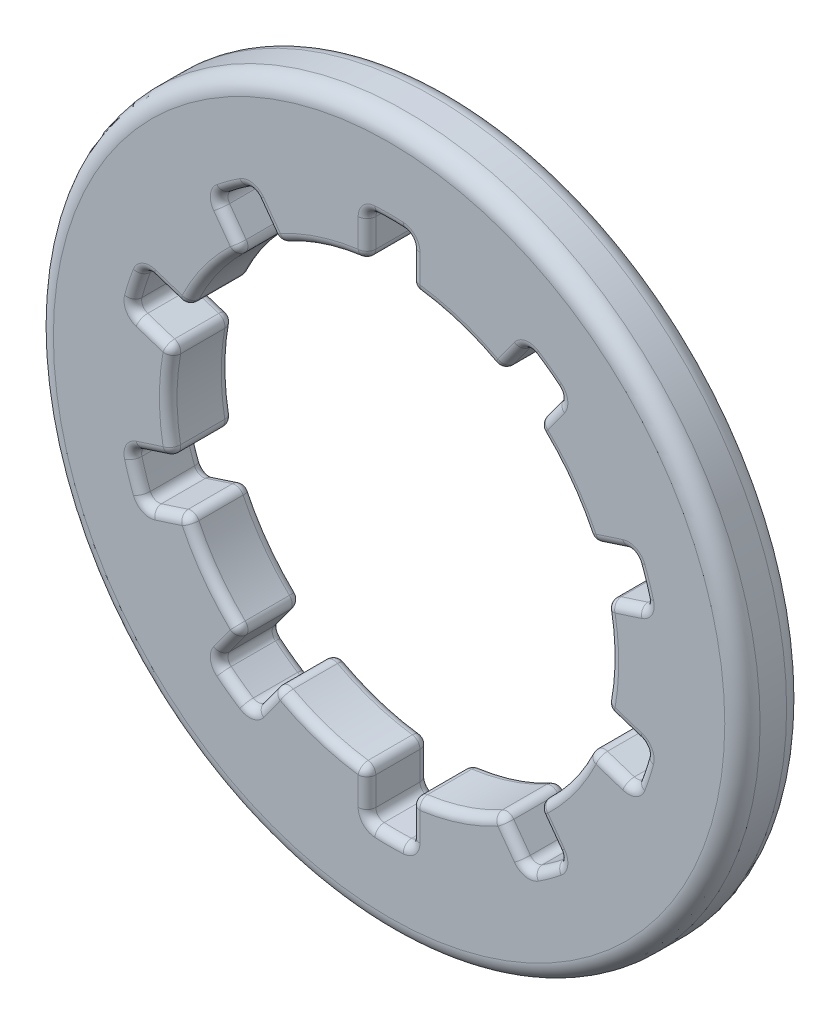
from build123d import *

# Parameters (mm, degrees)
ESQUISSE1_R                  = 4
BASE_EXTRUSION_DEPTH         = 0.7
CONG_1_R                     = 0.2
ENL_V_MAT_EXTRU_1_DEPTH      = 6.70000014
R_P_TITION_CIRCULAIRE1_COUNT = 5
R_P_TITION_CIRCULAIRE1_ANGLE = 144
CONG_2_R                     = 0.1


with BuildPart() as part:
    # Esquisse1 → Base-Extrusion (new body)
    with BuildSketch(Plane.XY):
        Circle(ESQUISSE1_R)
    extrude(amount=BASE_EXTRUSION_DEPTH)

    # Cong_1
    cong_1_edges = [part.edges().sort_by_distance(p)[0] for p in [
        (-4, 0, 0),
        (-4, 0, 0.7),
    ]]
    fillet(cong_1_edges, radius=CONG_1_R)

    # Esquisse2 → Enl_v. mat.-Extru.1 (cut, through all)
    with BuildSketch(Plane.XY.offset(0.7)):
        with BuildLine():
            Line((-0.25, 2.896118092), (-0.25, 2.487468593))
            ThreePointArc((-0.25, 2.487468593), (-2.5, 0), (-0.25, -2.487468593))
            Line((-0.25, -2.487468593), (-0.25, -2.896118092))
            ThreePointArc((-0.25, -2.896118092), (-0.222516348, -2.964975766), (-0.155172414, -2.995984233))
            ThreePointArc((-0.155172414, -2.995984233), (0, -3), (0.155172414, -2.995984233))
            ThreePointArc((0.155172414, -2.995984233), (0.222516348, -2.964975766), (0.25, -2.896118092))
            Line((0.25, -2.896118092), (0.25, -2.487468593))
            ThreePointArc((0.25, -2.487468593), (2.5, 0), (0.25, 2.487468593))
            Line((0.25, 2.487468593), (0.25, 2.896118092))
            ThreePointArc((0.25, 2.896118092), (0.222516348, 2.964975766), (0.155172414, 2.995984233))
            ThreePointArc((0.155172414, 2.995984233), (0, 3), (-0.155172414, 2.995984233))
            ThreePointArc((-0.155172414, 2.995984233), (-0.222516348, 2.964975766), (-0.25, 2.896118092))
        make_face()
    enl_v_mat_extru_1 = extrude(amount=-ENL_V_MAT_EXTRU_1_DEPTH, mode=Mode.SUBTRACT)

    # R_p_tition circulaire1: Enl_v. mat.-Extru.1 ×5 about axis
    r_p_tition_circulaire1_axis = Axis((0, 0, 0), (0, 0, -1))
    for i in range(1, R_P_TITION_CIRCULAIRE1_COUNT):
        add(enl_v_mat_extru_1.rotate(r_p_tition_circulaire1_axis, i * R_P_TITION_CIRCULAIRE1_ANGLE / (R_P_TITION_CIRCULAIRE1_COUNT - 1)), mode=Mode.SUBTRACT)

    # Cong_2
    cong_2_edges = [part.edges().sort_by_distance(p)[0] for p in [
        (-0.222516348, 2.964975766, 0),
        (-0.25, 2.691793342, 0),
        (-0.772542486, 2.377641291, 0),
        (-1.37994218, 2.324652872, 0),
        (-1.562749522, 2.52950761, 0),
        (-1.763355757, 2.427050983, 0),
        (-1.922788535, 2.267923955, 0),
        (-1.784450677, 2.030760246, 0),
        (-2.022542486, 1.469463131, 0),
        (-2.48279335, 1.069574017, 0),
        (-2.75109819, 1.127853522, 0),
        (-2.853169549, 0.927050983, 0),
        (-2.888620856, 0.704602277, 0),
        (-2.637301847, 0.594045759, 0),
        (-2.5, 0, 0),
        (-2.637301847, -0.594045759, 0),
        (-2.888620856, -0.704602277, 0),
        (-2.853169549, -0.927050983, 0),
        (-2.75109819, -1.127853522, 0),
        (-2.48279335, -1.069574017, 0),
        (-2.022542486, -1.469463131, 0),
        (-1.784450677, -2.030760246, 0),
        (-1.922788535, -2.267923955, 0),
        (-1.763355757, -2.427050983, 0),
        (-1.562749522, -2.52950761, 0),
        (-1.37994218, -2.324652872, 0),
        (-0.772542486, -2.377641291, 0),
        (-0.25, -2.691793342, 0),
        (-0.222516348, -2.964975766, 0),
        (0, -3, 0),
        (0.222516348, -2.964975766, 0),
        (0.25, -2.691793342, 0),
        (0.772542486, -2.377641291, 0),
        (1.37994218, -2.324652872, 0),
        (1.562749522, -2.52950761, 0),
        (1.763355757, -2.427050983, 0),
        (1.922788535, -2.267923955, 0),
        (1.784450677, -2.030760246, 0),
        (2.022542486, -1.469463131, 0),
        (2.48279335, -1.069574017, 0),
        (2.75109819, -1.127853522, 0),
        (2.853169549, -0.927050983, 0),
        (2.888620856, -0.704602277, 0),
        (2.637301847, -0.594045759, 0),
        (2.5, 0, 0),
        (2.637301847, 0.594045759, 0),
        (2.888620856, 0.704602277, 0),
        (2.853169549, 0.927050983, 0),
        (2.75109819, 1.127853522, 0),
        (2.48279335, 1.069574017, 0),
        (2.022542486, 1.469463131, 0),
        (1.784450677, 2.030760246, 0),
        (1.922788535, 2.267923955, 0),
        (1.763355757, 2.427050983, 0),
        (1.562749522, 2.52950761, 0),
        (1.37994218, 2.324652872, 0),
        (0.772542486, 2.377641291, 0),
        (0.25, 2.691793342, 0),
        (0.222516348, 2.964975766, 0),
        (0, 3, 0),
        (-0.222516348, 2.964975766, 0.7),
        (-0.25, 2.691793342, 0.7),
        (-0.772542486, 2.377641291, 0.7),
        (-1.37994218, 2.324652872, 0.7),
        (-1.562749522, 2.52950761, 0.7),
        (-1.763355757, 2.427050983, 0.7),
        (-1.922788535, 2.267923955, 0.7),
        (-1.784450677, 2.030760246, 0.7),
        (-2.022542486, 1.469463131, 0.7),
        (-2.48279335, 1.069574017, 0.7),
        (-2.75109819, 1.127853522, 0.7),
        (-2.853169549, 0.927050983, 0.7),
        (-2.888620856, 0.704602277, 0.7),
        (-2.637301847, 0.594045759, 0.7),
        (-2.5, 0, 0.7),
        (-2.637301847, -0.594045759, 0.7),
        (-2.888620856, -0.704602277, 0.7),
        (-2.853169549, -0.927050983, 0.7),
        (-2.75109819, -1.127853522, 0.7),
        (-2.48279335, -1.069574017, 0.7),
        (-2.022542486, -1.469463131, 0.7),
        (-1.784450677, -2.030760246, 0.7),
        (-1.922788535, -2.267923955, 0.7),
        (-1.763355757, -2.427050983, 0.7),
        (-1.562749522, -2.52950761, 0.7),
        (-1.37994218, -2.324652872, 0.7),
        (-0.772542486, -2.377641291, 0.7),
        (-0.25, -2.691793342, 0.7),
        (-0.222516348, -2.964975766, 0.7),
        (0, -3, 0.7),
        (0.222516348, -2.964975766, 0.7),
        (0.25, -2.691793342, 0.7),
        (0.772542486, -2.377641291, 0.7),
        (1.37994218, -2.324652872, 0.7),
        (1.562749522, -2.52950761, 0.7),
        (1.763355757, -2.427050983, 0.7),
        (1.922788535, -2.267923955, 0.7),
        (1.784450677, -2.030760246, 0.7),
        (2.022542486, -1.469463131, 0.7),
        (2.48279335, -1.069574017, 0.7),
        (2.75109819, -1.127853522, 0.7),
        (2.853169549, -0.927050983, 0.7),
        (2.888620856, -0.704602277, 0.7),
        (2.637301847, -0.594045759, 0.7),
        (2.5, 0, 0.7),
        (2.637301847, 0.594045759, 0.7),
        (2.888620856, 0.704602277, 0.7),
        (2.853169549, 0.927050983, 0.7),
        (2.75109819, 1.127853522, 0.7),
        (2.48279335, 1.069574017, 0.7),
        (2.022542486, 1.469463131, 0.7),
        (1.784450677, 2.030760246, 0.7),
        (1.922788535, 2.267923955, 0.7),
        (1.763355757, 2.427050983, 0.7),
        (1.562749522, 2.52950761, 0.7),
        (1.37994218, 2.324652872, 0.7),
        (0.772542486, 2.377641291, 0.7),
        (0.25, 2.691793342, 0.7),
        (0.222516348, 2.964975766, 0.7),
        (0, 3, 0.7),
        (-0.25, 2.487468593, 0.35),
        (-1.259843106, 2.159350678, 0.35),
        (-1.664351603, 1.865458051, 0.35),
        (-2.288468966, 1.006434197, 0.35),
        (-2.442977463, 0.530905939, 0.35),
        (-2.442977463, -0.530905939, 0.35),
        (-2.288468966, -1.006434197, 0.35),
        (-1.664351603, -1.865458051, 0.35),
        (-1.259843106, -2.159350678, 0.35),
        (-0.25, -2.487468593, 0.35),
        (0.25, -2.487468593, 0.35),
        (1.259843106, -2.159350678, 0.35),
        (1.664351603, -1.865458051, 0.35),
        (2.288468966, -1.006434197, 0.35),
        (2.442977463, -0.530905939, 0.35),
        (2.442977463, 0.530905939, 0.35),
        (2.288468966, 1.006434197, 0.35),
        (1.664351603, 1.865458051, 0.35),
        (1.259843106, 2.159350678, 0.35),
        (0.25, 2.487468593, 0.35),
    ]]
    fillet(cong_2_edges, radius=CONG_2_R)


solid = part.part
